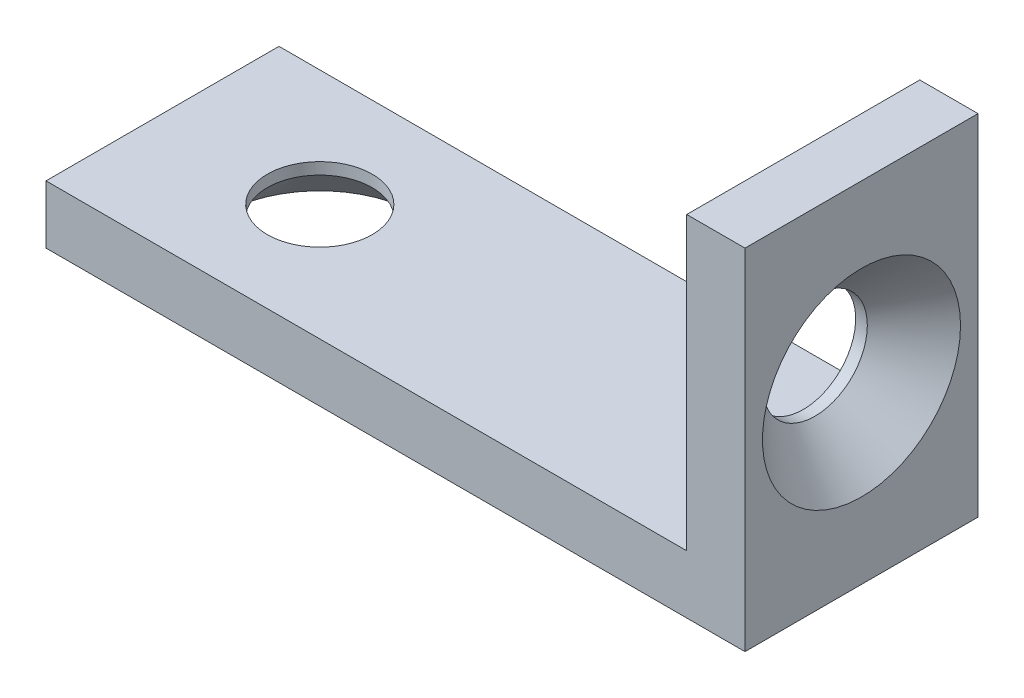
ISO-10303-21;
HEADER;
FILE_DESCRIPTION(('STEP AP214'),'2;1');
FILE_NAME('part.step','',(''),(''),'','','');
FILE_SCHEMA(('AUTOMOTIVE_DESIGN { 1 0 10303 214 1 1 1 1 }'));
ENDSEC;
DATA;
#1=APPLICATION_CONTEXT('core data for automotive mechanical design processes');
#2=APPLICATION_PROTOCOL_DEFINITION('international standard','automotive_design',2000,#1);
#3=PRODUCT_CONTEXT('',#1,'mechanical');
#4=PRODUCT('Part','Part','',(#3));
#5=PRODUCT_RELATED_PRODUCT_CATEGORY('part','',(#4));
#6=PRODUCT_DEFINITION_FORMATION('','',#4);
#7=PRODUCT_DEFINITION_CONTEXT('part definition',#1,'design');
#8=PRODUCT_DEFINITION('design','',#6,#7);
#9=PRODUCT_DEFINITION_SHAPE('','',#8);
#10=(LENGTH_UNIT() NAMED_UNIT(*) SI_UNIT(.MILLI.,.METRE.));
#11=(NAMED_UNIT(*) PLANE_ANGLE_UNIT() SI_UNIT($,.RADIAN.));
#12=(NAMED_UNIT(*) SI_UNIT($,.STERADIAN.) SOLID_ANGLE_UNIT());
#13=UNCERTAINTY_MEASURE_WITH_UNIT(LENGTH_MEASURE(1.E-05),#10,'distance_accuracy_value','');
#14=(GEOMETRIC_REPRESENTATION_CONTEXT(3) GLOBAL_UNCERTAINTY_ASSIGNED_CONTEXT((#13)) GLOBAL_UNIT_ASSIGNED_CONTEXT((#10,
#11,#12)) REPRESENTATION_CONTEXT('',''));
#15=CARTESIAN_POINT('',(0.,0.,0.));
#16=DIRECTION('',(0.,0.,1.));
#17=DIRECTION('',(1.,0.,0.));
#18=AXIS2_PLACEMENT_3D('',#15,#16,#17);
#19=CARTESIAN_POINT('',(5.,0.,0.));
#20=DIRECTION('',(1.,0.,0.));
#21=DIRECTION('',(0.,0.,-1.));
#22=AXIS2_PLACEMENT_3D('',#19,#20,#21);
#23=CONICAL_SURFACE('',#22,8.5,0.785398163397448);
#24=CARTESIAN_POINT('',(5.,0.,0.));
#25=DIRECTION('',(1.,0.,0.));
#26=DIRECTION('',(0.,0.,-1.));
#27=AXIS2_PLACEMENT_3D('',#24,#25,#26);
#28=CIRCLE('',#27,8.5);
#29=CARTESIAN_POINT('',(5.,0.,-8.5));
#30=VERTEX_POINT('',#29);
#31=EDGE_CURVE('E19',#30,#30,#28,.T.);
#32=ORIENTED_EDGE('',*,*,#31,.T.);
#33=EDGE_LOOP('',(#32));
#34=FACE_BOUND('',#33,.T.);
#35=CARTESIAN_POINT('',(1.,0.,0.));
#36=DIRECTION('',(-1.,0.,0.));
#37=DIRECTION('',(0.,0.,1.));
#38=AXIS2_PLACEMENT_3D('',#35,#36,#37);
#39=CIRCLE('',#38,4.5);
#40=CARTESIAN_POINT('',(1.,0.,4.5));
#41=VERTEX_POINT('',#40);
#42=EDGE_CURVE('E97',#41,#41,#39,.T.);
#43=ORIENTED_EDGE('',*,*,#42,.T.);
#44=EDGE_LOOP('',(#43));
#45=FACE_BOUND('',#44,.T.);
#46=ADVANCED_FACE('F15',(#34,#45),#23,.F.);
#47=CARTESIAN_POINT('',(2.5,-15.,0.));
#48=DIRECTION('',(0.,1.,0.));
#49=DIRECTION('',(0.,0.,1.));
#50=AXIS2_PLACEMENT_3D('',#47,#48,#49);
#51=PLANE('',#50);
#52=CARTESIAN_POINT('',(-41.5,-15.,0.));
#53=DIRECTION('',(0.,-1.,0.));
#54=DIRECTION('',(1.,0.,0.));
#55=AXIS2_PLACEMENT_3D('',#52,#53,#54);
#56=CIRCLE('',#55,8.49999999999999);
#57=CARTESIAN_POINT('',(-33.,-15.,0.));
#58=VERTEX_POINT('',#57);
#59=EDGE_CURVE('E81',#58,#58,#56,.F.);
#60=ORIENTED_EDGE('',*,*,#59,.T.);
#61=EDGE_LOOP('',(#60));
#62=FACE_BOUND('',#61,.T.);
#63=DIRECTION('',(0.,0.,1.));
#64=VECTOR('',#63,1.);
#65=CARTESIAN_POINT('',(5.,-15.,0.));
#66=LINE('',#65,#64);
#67=CARTESIAN_POINT('',(5.,-15.,-10.));
#68=VERTEX_POINT('',#67);
#69=CARTESIAN_POINT('',(5.,-15.,10.));
#70=VERTEX_POINT('',#69);
#71=EDGE_CURVE('E84',#68,#70,#66,.T.);
#72=ORIENTED_EDGE('',*,*,#71,.T.);
#73=DIRECTION('',(-1.,0.,0.));
#74=VECTOR('',#73,1.);
#75=CARTESIAN_POINT('',(2.5,-15.,10.));
#76=LINE('',#75,#74);
#77=CARTESIAN_POINT('',(-55.,-15.,10.));
#78=VERTEX_POINT('',#77);
#79=EDGE_CURVE('E72',#70,#78,#76,.T.);
#80=ORIENTED_EDGE('',*,*,#79,.T.);
#81=DIRECTION('',(0.,0.,1.));
#82=VECTOR('',#81,1.);
#83=CARTESIAN_POINT('',(-55.,-15.,0.));
#84=LINE('',#83,#82);
#85=CARTESIAN_POINT('',(-55.,-15.,-10.));
#86=VERTEX_POINT('',#85);
#87=EDGE_CURVE('E91',#86,#78,#84,.T.);
#88=ORIENTED_EDGE('',*,*,#87,.F.);
#89=DIRECTION('',(1.,0.,0.));
#90=VECTOR('',#89,1.);
#91=CARTESIAN_POINT('',(2.5,-15.,-10.));
#92=LINE('',#91,#90);
#93=EDGE_CURVE('E87',#86,#68,#92,.T.);
#94=ORIENTED_EDGE('',*,*,#93,.T.);
#95=EDGE_LOOP('',(#72,#80,#88,#94));
#96=FACE_BOUND('',#95,.T.);
#97=ADVANCED_FACE('F85',(#62,#96),#51,.F.);
#98=CARTESIAN_POINT('',(5.,0.,0.));
#99=DIRECTION('',(-1.,0.,0.));
#100=DIRECTION('',(0.,0.,1.));
#101=AXIS2_PLACEMENT_3D('',#98,#99,#100);
#102=PLANE('',#101);
#103=ORIENTED_EDGE('',*,*,#31,.F.);
#104=EDGE_LOOP('',(#103));
#105=FACE_BOUND('',#104,.T.);
#106=DIRECTION('',(0.,0.,-1.));
#107=VECTOR('',#106,1.);
#108=CARTESIAN_POINT('',(5.,15.,0.));
#109=LINE('',#108,#107);
#110=CARTESIAN_POINT('',(5.,15.,-10.));
#111=VERTEX_POINT('',#110);
#112=CARTESIAN_POINT('',(5.,15.,10.));
#113=VERTEX_POINT('',#112);
#114=EDGE_CURVE('E66',#111,#113,#109,.F.);
#115=ORIENTED_EDGE('',*,*,#114,.T.);
#116=DIRECTION('',(0.,1.,0.));
#117=VECTOR('',#116,1.);
#118=CARTESIAN_POINT('',(5.,0.,10.));
#119=LINE('',#118,#117);
#120=EDGE_CURVE('E75',#113,#70,#119,.F.);
#121=ORIENTED_EDGE('',*,*,#120,.T.);
#122=ORIENTED_EDGE('',*,*,#71,.F.);
#123=DIRECTION('',(0.,1.,0.));
#124=VECTOR('',#123,1.);
#125=CARTESIAN_POINT('',(5.,0.,-10.));
#126=LINE('',#125,#124);
#127=EDGE_CURVE('E133',#68,#111,#126,.T.);
#128=ORIENTED_EDGE('',*,*,#127,.T.);
#129=EDGE_LOOP('',(#115,#121,#122,#128));
#130=FACE_BOUND('',#129,.T.);
#131=ADVANCED_FACE('F90',(#105,#130),#102,.F.);
#132=CARTESIAN_POINT('',(2.5,15.,0.));
#133=DIRECTION('',(0.,-1.,0.));
#134=DIRECTION('',(0.,0.,-1.));
#135=AXIS2_PLACEMENT_3D('',#132,#133,#134);
#136=PLANE('',#135);
#137=ORIENTED_EDGE('',*,*,#114,.F.);
#138=DIRECTION('',(1.,0.,0.));
#139=VECTOR('',#138,1.);
#140=CARTESIAN_POINT('',(2.5,15.,-10.));
#141=LINE('',#140,#139);
#142=CARTESIAN_POINT('',(0.,15.,-10.));
#143=VERTEX_POINT('',#142);
#144=EDGE_CURVE('E130',#111,#143,#141,.F.);
#145=ORIENTED_EDGE('',*,*,#144,.T.);
#146=DIRECTION('',(0.,0.,1.));
#147=VECTOR('',#146,1.);
#148=CARTESIAN_POINT('',(0.,15.,0.));
#149=LINE('',#148,#147);
#150=CARTESIAN_POINT('',(0.,15.,10.));
#151=VERTEX_POINT('',#150);
#152=EDGE_CURVE('E125',#151,#143,#149,.F.);
#153=ORIENTED_EDGE('',*,*,#152,.F.);
#154=DIRECTION('',(-1.,0.,0.));
#155=VECTOR('',#154,1.);
#156=CARTESIAN_POINT('',(2.5,15.,10.));
#157=LINE('',#156,#155);
#158=EDGE_CURVE('E80',#151,#113,#157,.F.);
#159=ORIENTED_EDGE('',*,*,#158,.T.);
#160=EDGE_LOOP('',(#137,#145,#153,#159));
#161=FACE_BOUND('',#160,.T.);
#162=ADVANCED_FACE('F156',(#161),#136,.F.);
#163=CARTESIAN_POINT('',(1.,0.,0.));
#164=DIRECTION('',(-1.,0.,0.));
#165=DIRECTION('',(0.,0.,1.));
#166=AXIS2_PLACEMENT_3D('',#163,#164,#165);
#167=CYLINDRICAL_SURFACE('',#166,4.5);
#168=CARTESIAN_POINT('',(0.,0.,0.));
#169=DIRECTION('',(-1.,0.,0.));
#170=DIRECTION('',(0.,0.,1.));
#171=AXIS2_PLACEMENT_3D('',#168,#169,#170);
#172=CIRCLE('',#171,4.5);
#173=CARTESIAN_POINT('',(0.,0.,4.5));
#174=VERTEX_POINT('',#173);
#175=EDGE_CURVE('E103',#174,#174,#172,.F.);
#176=ORIENTED_EDGE('',*,*,#175,.F.);
#177=EDGE_LOOP('',(#176));
#178=FACE_BOUND('',#177,.T.);
#179=ORIENTED_EDGE('',*,*,#42,.F.);
#180=EDGE_LOOP('',(#179));
#181=FACE_BOUND('',#180,.T.);
#182=ADVANCED_FACE('F112',(#178,#181),#167,.F.);
#183=CARTESIAN_POINT('',(-41.5,-15.,0.));
#184=DIRECTION('',(0.,-1.,0.));
#185=DIRECTION('',(1.,0.,0.));
#186=AXIS2_PLACEMENT_3D('',#183,#184,#185);
#187=CONICAL_SURFACE('',#186,8.5,0.785398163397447);
#188=ORIENTED_EDGE('',*,*,#59,.F.);
#189=EDGE_LOOP('',(#188));
#190=FACE_BOUND('',#189,.T.);
#191=CARTESIAN_POINT('',(-41.5,-11.,0.));
#192=DIRECTION('',(0.,1.,0.));
#193=DIRECTION('',(0.,0.,1.));
#194=AXIS2_PLACEMENT_3D('',#191,#192,#193);
#195=CIRCLE('',#194,4.5);
#196=CARTESIAN_POINT('',(-41.5,-11.,4.5));
#197=VERTEX_POINT('',#196);
#198=EDGE_CURVE('E105',#197,#197,#195,.T.);
#199=ORIENTED_EDGE('',*,*,#198,.T.);
#200=EDGE_LOOP('',(#199));
#201=FACE_BOUND('',#200,.T.);
#202=ADVANCED_FACE('F17',(#190,#201),#187,.F.);
#203=CARTESIAN_POINT('',(2.5,0.,10.));
#204=DIRECTION('',(0.,0.,-1.));
#205=DIRECTION('',(-1.,0.,0.));
#206=AXIS2_PLACEMENT_3D('',#203,#204,#205);
#207=PLANE('',#206);
#208=ORIENTED_EDGE('',*,*,#158,.F.);
#209=DIRECTION('',(0.,1.,0.));
#210=VECTOR('',#209,1.);
#211=CARTESIAN_POINT('',(0.,0.,10.));
#212=LINE('',#211,#210);
#213=CARTESIAN_POINT('',(0.,-10.,10.));
#214=VERTEX_POINT('',#213);
#215=EDGE_CURVE('E127',#214,#151,#212,.T.);
#216=ORIENTED_EDGE('',*,*,#215,.F.);
#217=DIRECTION('',(1.,0.,0.));
#218=VECTOR('',#217,1.);
#219=CARTESIAN_POINT('',(-25.,-10.,10.));
#220=LINE('',#219,#218);
#221=CARTESIAN_POINT('',(-55.,-10.,10.));
#222=VERTEX_POINT('',#221);
#223=EDGE_CURVE('E116',#214,#222,#220,.F.);
#224=ORIENTED_EDGE('',*,*,#223,.T.);
#225=DIRECTION('',(0.,1.,0.));
#226=VECTOR('',#225,1.);
#227=CARTESIAN_POINT('',(-55.,-12.5,10.));
#228=LINE('',#227,#226);
#229=EDGE_CURVE('E78',#78,#222,#228,.T.);
#230=ORIENTED_EDGE('',*,*,#229,.F.);
#231=ORIENTED_EDGE('',*,*,#79,.F.);
#232=ORIENTED_EDGE('',*,*,#120,.F.);
#233=EDGE_LOOP('',(#208,#216,#224,#230,#231,#232));
#234=FACE_BOUND('',#233,.T.);
#235=ADVANCED_FACE('F74',(#234),#207,.F.);
#236=CARTESIAN_POINT('',(-55.,-12.5,0.));
#237=DIRECTION('',(-1.,0.,0.));
#238=DIRECTION('',(0.,0.,1.));
#239=AXIS2_PLACEMENT_3D('',#236,#237,#238);
#240=PLANE('',#239);
#241=ORIENTED_EDGE('',*,*,#87,.T.);
#242=ORIENTED_EDGE('',*,*,#229,.T.);
#243=DIRECTION('',(0.,0.,-1.));
#244=VECTOR('',#243,1.);
#245=CARTESIAN_POINT('',(-55.,-10.,0.));
#246=LINE('',#245,#244);
#247=CARTESIAN_POINT('',(-55.,-10.,-10.));
#248=VERTEX_POINT('',#247);
#249=EDGE_CURVE('E118',#222,#248,#246,.T.);
#250=ORIENTED_EDGE('',*,*,#249,.T.);
#251=DIRECTION('',(0.,1.,0.));
#252=VECTOR('',#251,1.);
#253=CARTESIAN_POINT('',(-55.,0.,-10.));
#254=LINE('',#253,#252);
#255=EDGE_CURVE('E136',#248,#86,#254,.F.);
#256=ORIENTED_EDGE('',*,*,#255,.T.);
#257=EDGE_LOOP('',(#241,#242,#250,#256));
#258=FACE_BOUND('',#257,.T.);
#259=ADVANCED_FACE('F141',(#258),#240,.T.);
#260=CARTESIAN_POINT('',(2.5,0.,-10.));
#261=DIRECTION('',(0.,0.,1.));
#262=DIRECTION('',(1.,0.,0.));
#263=AXIS2_PLACEMENT_3D('',#260,#261,#262);
#264=PLANE('',#263);
#265=ORIENTED_EDGE('',*,*,#144,.F.);
#266=ORIENTED_EDGE('',*,*,#127,.F.);
#267=ORIENTED_EDGE('',*,*,#93,.F.);
#268=ORIENTED_EDGE('',*,*,#255,.F.);
#269=DIRECTION('',(1.,0.,0.));
#270=VECTOR('',#269,1.);
#271=CARTESIAN_POINT('',(-25.,-10.,-10.));
#272=LINE('',#271,#270);
#273=CARTESIAN_POINT('',(0.,-10.,-10.));
#274=VERTEX_POINT('',#273);
#275=EDGE_CURVE('E147',#248,#274,#272,.T.);
#276=ORIENTED_EDGE('',*,*,#275,.T.);
#277=DIRECTION('',(0.,1.,0.));
#278=VECTOR('',#277,1.);
#279=CARTESIAN_POINT('',(0.,0.,-10.));
#280=LINE('',#279,#278);
#281=EDGE_CURVE('E34',#143,#274,#280,.F.);
#282=ORIENTED_EDGE('',*,*,#281,.F.);
#283=EDGE_LOOP('',(#265,#266,#267,#268,#276,#282));
#284=FACE_BOUND('',#283,.T.);
#285=ADVANCED_FACE('F154',(#284),#264,.F.);
#286=CARTESIAN_POINT('',(0.,0.,0.));
#287=DIRECTION('',(-1.,0.,0.));
#288=DIRECTION('',(0.,0.,1.));
#289=AXIS2_PLACEMENT_3D('',#286,#287,#288);
#290=PLANE('',#289);
#291=ORIENTED_EDGE('',*,*,#175,.T.);
#292=EDGE_LOOP('',(#291));
#293=FACE_BOUND('',#292,.T.);
#294=ORIENTED_EDGE('',*,*,#152,.T.);
#295=ORIENTED_EDGE('',*,*,#281,.T.);
#296=DIRECTION('',(0.,0.,-1.));
#297=VECTOR('',#296,1.);
#298=CARTESIAN_POINT('',(0.,-10.,0.));
#299=LINE('',#298,#297);
#300=EDGE_CURVE('E25',#274,#214,#299,.F.);
#301=ORIENTED_EDGE('',*,*,#300,.T.);
#302=ORIENTED_EDGE('',*,*,#215,.T.);
#303=EDGE_LOOP('',(#294,#295,#301,#302));
#304=FACE_BOUND('',#303,.T.);
#305=ADVANCED_FACE('F149',(#293,#304),#290,.T.);
#306=CARTESIAN_POINT('',(-41.5,-11.,0.));
#307=DIRECTION('',(0.,1.,0.));
#308=DIRECTION('',(0.,0.,1.));
#309=AXIS2_PLACEMENT_3D('',#306,#307,#308);
#310=CYLINDRICAL_SURFACE('',#309,4.5);
#311=CARTESIAN_POINT('',(-41.5,-10.,0.));
#312=DIRECTION('',(0.,1.,0.));
#313=DIRECTION('',(0.,0.,1.));
#314=AXIS2_PLACEMENT_3D('',#311,#312,#313);
#315=CIRCLE('',#314,4.5);
#316=CARTESIAN_POINT('',(-41.5,-10.,4.5));
#317=VERTEX_POINT('',#316);
#318=EDGE_CURVE('E10',#317,#317,#315,.T.);
#319=ORIENTED_EDGE('',*,*,#318,.T.);
#320=EDGE_LOOP('',(#319));
#321=FACE_BOUND('',#320,.T.);
#322=ORIENTED_EDGE('',*,*,#198,.F.);
#323=EDGE_LOOP('',(#322));
#324=FACE_BOUND('',#323,.T.);
#325=ADVANCED_FACE('F169',(#321,#324),#310,.F.);
#326=CARTESIAN_POINT('',(-25.,-10.,0.));
#327=DIRECTION('',(0.,-1.,0.));
#328=DIRECTION('',(0.,0.,-1.));
#329=AXIS2_PLACEMENT_3D('',#326,#327,#328);
#330=PLANE('',#329);
#331=ORIENTED_EDGE('',*,*,#318,.F.);
#332=EDGE_LOOP('',(#331));
#333=FACE_BOUND('',#332,.T.);
#334=ORIENTED_EDGE('',*,*,#275,.F.);
#335=ORIENTED_EDGE('',*,*,#249,.F.);
#336=ORIENTED_EDGE('',*,*,#223,.F.);
#337=ORIENTED_EDGE('',*,*,#300,.F.);
#338=EDGE_LOOP('',(#334,#335,#336,#337));
#339=FACE_BOUND('',#338,.T.);
#340=ADVANCED_FACE('F144',(#333,#339),#330,.F.);
#341=CLOSED_SHELL('',(#46,#97,#131,#162,#182,#202,#235,#259,#285,#305,#325,#340));
#342=MANIFOLD_SOLID_BREP('B1',#341);
#343=ADVANCED_BREP_SHAPE_REPRESENTATION('',(#18,#342),#14);
#344=SHAPE_DEFINITION_REPRESENTATION(#9,#343);
ENDSEC;
END-ISO-10303-21;
